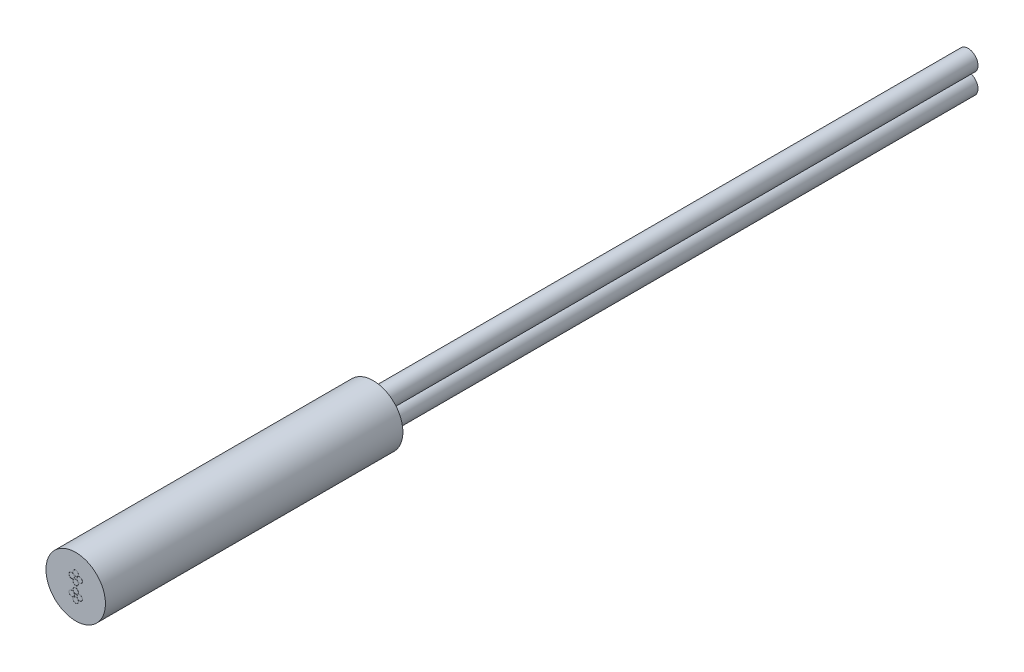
ISO-10303-21;
HEADER;
FILE_DESCRIPTION(('STEP AP214'),'2;1');
FILE_NAME('part.step','',(''),(''),'','','');
FILE_SCHEMA(('AUTOMOTIVE_DESIGN { 1 0 10303 214 1 1 1 1 }'));
ENDSEC;
DATA;
#1=APPLICATION_CONTEXT('core data for automotive mechanical design processes');
#2=APPLICATION_PROTOCOL_DEFINITION('international standard','automotive_design',2000,#1);
#3=PRODUCT_CONTEXT('',#1,'mechanical');
#4=PRODUCT('Part','Part','',(#3));
#5=PRODUCT_RELATED_PRODUCT_CATEGORY('part','',(#4));
#6=PRODUCT_DEFINITION_FORMATION('','',#4);
#7=PRODUCT_DEFINITION_CONTEXT('part definition',#1,'design');
#8=PRODUCT_DEFINITION('design','',#6,#7);
#9=PRODUCT_DEFINITION_SHAPE('','',#8);
#10=(LENGTH_UNIT() NAMED_UNIT(*) SI_UNIT(.MILLI.,.METRE.));
#11=(NAMED_UNIT(*) PLANE_ANGLE_UNIT() SI_UNIT($,.RADIAN.));
#12=(NAMED_UNIT(*) SI_UNIT($,.STERADIAN.) SOLID_ANGLE_UNIT());
#13=UNCERTAINTY_MEASURE_WITH_UNIT(LENGTH_MEASURE(1.E-05),#10,'distance_accuracy_value','');
#14=(GEOMETRIC_REPRESENTATION_CONTEXT(3) GLOBAL_UNCERTAINTY_ASSIGNED_CONTEXT((#13)) GLOBAL_UNIT_ASSIGNED_CONTEXT((#10,
#11,#12)) REPRESENTATION_CONTEXT('',''));
#15=CARTESIAN_POINT('',(0.,0.,0.));
#16=DIRECTION('',(0.,0.,1.));
#17=DIRECTION('',(1.,0.,0.));
#18=AXIS2_PLACEMENT_3D('',#15,#16,#17);
#19=CARTESIAN_POINT('',(0.,0.,-15.));
#20=DIRECTION('',(0.,0.,1.));
#21=DIRECTION('',(1.,0.,0.));
#22=AXIS2_PLACEMENT_3D('',#19,#20,#21);
#23=CYLINDRICAL_SURFACE('',#22,1.5);
#24=CARTESIAN_POINT('',(0.,0.,-15.));
#25=DIRECTION('',(0.,0.,1.));
#26=DIRECTION('',(1.,0.,0.));
#27=AXIS2_PLACEMENT_3D('',#24,#25,#26);
#28=CIRCLE('',#27,1.5);
#29=CARTESIAN_POINT('',(1.5,0.,-15.));
#30=VERTEX_POINT('',#29);
#31=EDGE_CURVE('E43',#30,#30,#28,.T.);
#32=ORIENTED_EDGE('',*,*,#31,.T.);
#33=EDGE_LOOP('',(#32));
#34=FACE_BOUND('',#33,.T.);
#35=CARTESIAN_POINT('',(0.,0.,0.));
#36=DIRECTION('',(0.,0.,1.));
#37=DIRECTION('',(1.,0.,0.));
#38=AXIS2_PLACEMENT_3D('',#35,#36,#37);
#39=CIRCLE('',#38,1.5);
#40=CARTESIAN_POINT('',(1.5,0.,0.));
#41=VERTEX_POINT('',#40);
#42=EDGE_CURVE('E47',#41,#41,#39,.T.);
#43=ORIENTED_EDGE('',*,*,#42,.F.);
#44=EDGE_LOOP('',(#43));
#45=FACE_BOUND('',#44,.T.);
#46=ADVANCED_FACE('F33',(#34,#45),#23,.T.);
#47=CARTESIAN_POINT('',(0.,0.,-15.));
#48=DIRECTION('',(0.,0.,1.));
#49=DIRECTION('',(1.,0.,0.));
#50=AXIS2_PLACEMENT_3D('',#47,#48,#49);
#51=PLANE('',#50);
#52=CARTESIAN_POINT('',(0.,-0.51,-15.));
#53=DIRECTION('',(0.,0.,1.));
#54=DIRECTION('',(1.,0.,0.));
#55=AXIS2_PLACEMENT_3D('',#52,#53,#54);
#56=CIRCLE('',#55,0.5);
#57=CARTESIAN_POINT('',(0.5,-0.51,-15.));
#58=VERTEX_POINT('',#57);
#59=EDGE_CURVE('E10',#58,#58,#56,.F.);
#60=ORIENTED_EDGE('',*,*,#59,.F.);
#61=EDGE_LOOP('',(#60));
#62=FACE_BOUND('',#61,.T.);
#63=CARTESIAN_POINT('',(0.,0.51,-15.));
#64=DIRECTION('',(0.,0.,1.));
#65=DIRECTION('',(1.,0.,0.));
#66=AXIS2_PLACEMENT_3D('',#63,#64,#65);
#67=CIRCLE('',#66,0.5);
#68=CARTESIAN_POINT('',(0.5,0.51,-15.));
#69=VERTEX_POINT('',#68);
#70=EDGE_CURVE('E39',#69,#69,#67,.F.);
#71=ORIENTED_EDGE('',*,*,#70,.F.);
#72=EDGE_LOOP('',(#71));
#73=FACE_BOUND('',#72,.T.);
#74=ORIENTED_EDGE('',*,*,#31,.F.);
#75=EDGE_LOOP('',(#74));
#76=FACE_BOUND('',#75,.T.);
#77=ADVANCED_FACE('F175',(#62,#73,#76),#51,.F.);
#78=CARTESIAN_POINT('',(0.,0.,0.));
#79=DIRECTION('',(0.,0.,1.));
#80=DIRECTION('',(1.,0.,0.));
#81=AXIS2_PLACEMENT_3D('',#78,#79,#80);
#82=PLANE('',#81);
#83=CARTESIAN_POINT('',(-0.201525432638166,-0.389025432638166,0.));
#84=DIRECTION('',(0.,0.,1.));
#85=DIRECTION('',(-1.,0.,0.));
#86=AXIS2_PLACEMENT_3D('',#83,#84,#85);
#87=CIRCLE('',#86,0.1375);
#88=CARTESIAN_POINT('',(-0.339025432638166,-0.389025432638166,0.));
#89=VERTEX_POINT('',#88);
#90=EDGE_CURVE('E95',#89,#89,#87,.T.);
#91=ORIENTED_EDGE('',*,*,#90,.F.);
#92=EDGE_LOOP('',(#91));
#93=FACE_BOUND('',#92,.T.);
#94=CARTESIAN_POINT('',(0.,0.1875,0.));
#95=DIRECTION('',(0.,0.,1.));
#96=DIRECTION('',(1.,0.,0.));
#97=AXIS2_PLACEMENT_3D('',#94,#95,#96);
#98=CIRCLE('',#97,0.1375);
#99=CARTESIAN_POINT('',(0.1375,0.1875,0.));
#100=VERTEX_POINT('',#99);
#101=EDGE_CURVE('E109',#100,#100,#98,.T.);
#102=ORIENTED_EDGE('',*,*,#101,.F.);
#103=EDGE_LOOP('',(#102));
#104=FACE_BOUND('',#103,.T.);
#105=CARTESIAN_POINT('',(0.201525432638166,0.389025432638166,0.));
#106=DIRECTION('',(0.,0.,1.));
#107=DIRECTION('',(1.,0.,0.));
#108=AXIS2_PLACEMENT_3D('',#105,#106,#107);
#109=CIRCLE('',#108,0.1375);
#110=CARTESIAN_POINT('',(0.339025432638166,0.389025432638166,0.));
#111=VERTEX_POINT('',#110);
#112=EDGE_CURVE('E71',#111,#111,#109,.T.);
#113=ORIENTED_EDGE('',*,*,#112,.F.);
#114=EDGE_LOOP('',(#113));
#115=FACE_BOUND('',#114,.T.);
#116=CARTESIAN_POINT('',(-0.201525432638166,0.389025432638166,0.));
#117=DIRECTION('',(0.,0.,1.));
#118=DIRECTION('',(1.,0.,0.));
#119=AXIS2_PLACEMENT_3D('',#116,#117,#118);
#120=CIRCLE('',#119,0.1375);
#121=CARTESIAN_POINT('',(-0.0640254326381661,0.389025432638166,0.));
#122=VERTEX_POINT('',#121);
#123=EDGE_CURVE('E85',#122,#122,#120,.T.);
#124=ORIENTED_EDGE('',*,*,#123,.F.);
#125=EDGE_LOOP('',(#124));
#126=FACE_BOUND('',#125,.T.);
#127=CARTESIAN_POINT('',(0.,-0.590550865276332,0.));
#128=DIRECTION('',(0.,0.,1.));
#129=DIRECTION('',(-1.,0.,0.));
#130=AXIS2_PLACEMENT_3D('',#127,#128,#129);
#131=CIRCLE('',#130,0.1375);
#132=CARTESIAN_POINT('',(-0.1375,-0.590550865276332,0.));
#133=VERTEX_POINT('',#132);
#134=EDGE_CURVE('E143',#133,#133,#131,.T.);
#135=ORIENTED_EDGE('',*,*,#134,.F.);
#136=EDGE_LOOP('',(#135));
#137=FACE_BOUND('',#136,.T.);
#138=CARTESIAN_POINT('',(0.,-0.1875,0.));
#139=DIRECTION('',(0.,0.,1.));
#140=DIRECTION('',(-1.,0.,0.));
#141=AXIS2_PLACEMENT_3D('',#138,#139,#140);
#142=CIRCLE('',#141,0.1375);
#143=CARTESIAN_POINT('',(-0.1375,-0.1875,0.));
#144=VERTEX_POINT('',#143);
#145=EDGE_CURVE('E119',#144,#144,#142,.T.);
#146=ORIENTED_EDGE('',*,*,#145,.F.);
#147=EDGE_LOOP('',(#146));
#148=FACE_BOUND('',#147,.T.);
#149=CARTESIAN_POINT('',(0.201525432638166,-0.389025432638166,0.));
#150=DIRECTION('',(0.,0.,1.));
#151=DIRECTION('',(-1.,0.,0.));
#152=AXIS2_PLACEMENT_3D('',#149,#150,#151);
#153=CIRCLE('',#152,0.1375);
#154=CARTESIAN_POINT('',(0.064025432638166,-0.389025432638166,0.));
#155=VERTEX_POINT('',#154);
#156=EDGE_CURVE('E131',#155,#155,#153,.T.);
#157=ORIENTED_EDGE('',*,*,#156,.F.);
#158=EDGE_LOOP('',(#157));
#159=FACE_BOUND('',#158,.T.);
#160=CARTESIAN_POINT('',(0.,0.590550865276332,0.));
#161=DIRECTION('',(0.,0.,1.));
#162=DIRECTION('',(1.,0.,0.));
#163=AXIS2_PLACEMENT_3D('',#160,#161,#162);
#164=CIRCLE('',#163,0.1375);
#165=CARTESIAN_POINT('',(0.1375,0.590550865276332,0.));
#166=VERTEX_POINT('',#165);
#167=EDGE_CURVE('E59',#166,#166,#164,.T.);
#168=ORIENTED_EDGE('',*,*,#167,.F.);
#169=EDGE_LOOP('',(#168));
#170=FACE_BOUND('',#169,.T.);
#171=ORIENTED_EDGE('',*,*,#42,.T.);
#172=EDGE_LOOP('',(#171));
#173=FACE_BOUND('',#172,.T.);
#174=ADVANCED_FACE('F171',(#93,#104,#115,#126,#137,#148,#159,#170,#173),#82,.T.);
#175=CARTESIAN_POINT('',(0.,0.51,-45.));
#176=DIRECTION('',(0.,0.,1.));
#177=DIRECTION('',(1.,0.,0.));
#178=AXIS2_PLACEMENT_3D('',#175,#176,#177);
#179=CYLINDRICAL_SURFACE('',#178,0.5);
#180=CARTESIAN_POINT('',(0.,0.51,-45.));
#181=DIRECTION('',(0.,0.,-1.));
#182=DIRECTION('',(-1.,0.,0.));
#183=AXIS2_PLACEMENT_3D('',#180,#181,#182);
#184=CIRCLE('',#183,0.5);
#185=CARTESIAN_POINT('',(-0.5,0.51,-45.));
#186=VERTEX_POINT('',#185);
#187=EDGE_CURVE('E51',#186,#186,#184,.T.);
#188=ORIENTED_EDGE('',*,*,#187,.F.);
#189=EDGE_LOOP('',(#188));
#190=FACE_BOUND('',#189,.T.);
#191=ORIENTED_EDGE('',*,*,#70,.T.);
#192=EDGE_LOOP('',(#191));
#193=FACE_BOUND('',#192,.T.);
#194=ADVANCED_FACE('F174',(#190,#193),#179,.T.);
#195=CARTESIAN_POINT('',(0.,0.51,-45.));
#196=DIRECTION('',(0.,0.,-1.));
#197=DIRECTION('',(-1.,0.,0.));
#198=AXIS2_PLACEMENT_3D('',#195,#196,#197);
#199=PLANE('',#198);
#200=ORIENTED_EDGE('',*,*,#187,.T.);
#201=EDGE_LOOP('',(#200));
#202=FACE_BOUND('',#201,.T.);
#203=ADVANCED_FACE('F202',(#202),#199,.T.);
#204=CARTESIAN_POINT('',(0.,-0.51,-45.));
#205=DIRECTION('',(0.,0.,1.));
#206=DIRECTION('',(1.,0.,0.));
#207=AXIS2_PLACEMENT_3D('',#204,#205,#206);
#208=CYLINDRICAL_SURFACE('',#207,0.5);
#209=CARTESIAN_POINT('',(0.,-0.51,-45.));
#210=DIRECTION('',(0.,0.,-1.));
#211=DIRECTION('',(-1.,0.,0.));
#212=AXIS2_PLACEMENT_3D('',#209,#210,#211);
#213=CIRCLE('',#212,0.5);
#214=CARTESIAN_POINT('',(-0.5,-0.51,-45.));
#215=VERTEX_POINT('',#214);
#216=EDGE_CURVE('E55',#215,#215,#213,.T.);
#217=ORIENTED_EDGE('',*,*,#216,.F.);
#218=EDGE_LOOP('',(#217));
#219=FACE_BOUND('',#218,.T.);
#220=ORIENTED_EDGE('',*,*,#59,.T.);
#221=EDGE_LOOP('',(#220));
#222=FACE_BOUND('',#221,.T.);
#223=ADVANCED_FACE('F206',(#219,#222),#208,.T.);
#224=CARTESIAN_POINT('',(0.,-0.51,-45.));
#225=DIRECTION('',(0.,0.,-1.));
#226=DIRECTION('',(-1.,0.,0.));
#227=AXIS2_PLACEMENT_3D('',#224,#225,#226);
#228=PLANE('',#227);
#229=ORIENTED_EDGE('',*,*,#216,.T.);
#230=EDGE_LOOP('',(#229));
#231=FACE_BOUND('',#230,.T.);
#232=ADVANCED_FACE('F210',(#231),#228,.T.);
#233=CARTESIAN_POINT('',(0.,0.590550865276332,-0.1));
#234=DIRECTION('',(0.,0.,1.));
#235=DIRECTION('',(1.,0.,0.));
#236=AXIS2_PLACEMENT_3D('',#233,#234,#235);
#237=CYLINDRICAL_SURFACE('',#236,0.1375);
#238=CARTESIAN_POINT('',(0.,0.590550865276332,-0.1));
#239=DIRECTION('',(0.,0.,1.));
#240=DIRECTION('',(1.,0.,0.));
#241=AXIS2_PLACEMENT_3D('',#238,#239,#240);
#242=CIRCLE('',#241,0.1375);
#243=CARTESIAN_POINT('',(0.1375,0.590550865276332,-0.1));
#244=VERTEX_POINT('',#243);
#245=EDGE_CURVE('E58',#244,#244,#242,.T.);
#246=ORIENTED_EDGE('',*,*,#245,.F.);
#247=EDGE_LOOP('',(#246));
#248=FACE_BOUND('',#247,.T.);
#249=ORIENTED_EDGE('',*,*,#167,.T.);
#250=EDGE_LOOP('',(#249));
#251=FACE_BOUND('',#250,.T.);
#252=ADVANCED_FACE('F214',(#248,#251),#237,.F.);
#253=CARTESIAN_POINT('',(0.,0.590550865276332,-0.1));
#254=DIRECTION('',(0.,0.,1.));
#255=DIRECTION('',(1.,0.,0.));
#256=AXIS2_PLACEMENT_3D('',#253,#254,#255);
#257=PLANE('',#256);
#258=CARTESIAN_POINT('',(0.,0.590550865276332,-0.1));
#259=DIRECTION('',(0.,0.,1.));
#260=DIRECTION('',(1.,0.,0.));
#261=AXIS2_PLACEMENT_3D('',#258,#259,#260);
#262=CIRCLE('',#261,0.1325);
#263=CARTESIAN_POINT('',(0.1325,0.590550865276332,-0.1));
#264=VERTEX_POINT('',#263);
#265=EDGE_CURVE('E62',#264,#264,#262,.T.);
#266=ORIENTED_EDGE('',*,*,#265,.F.);
#267=EDGE_LOOP('',(#266));
#268=FACE_BOUND('',#267,.T.);
#269=ORIENTED_EDGE('',*,*,#245,.T.);
#270=EDGE_LOOP('',(#269));
#271=FACE_BOUND('',#270,.T.);
#272=ADVANCED_FACE('F218',(#268,#271),#257,.T.);
#273=CARTESIAN_POINT('',(0.,0.590550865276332,-0.1));
#274=DIRECTION('',(0.,0.,1.));
#275=DIRECTION('',(1.,0.,0.));
#276=AXIS2_PLACEMENT_3D('',#273,#274,#275);
#277=CYLINDRICAL_SURFACE('',#276,0.1325);
#278=ORIENTED_EDGE('',*,*,#265,.T.);
#279=EDGE_LOOP('',(#278));
#280=FACE_BOUND('',#279,.T.);
#281=CARTESIAN_POINT('',(0.,0.590550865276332,0.));
#282=DIRECTION('',(0.,0.,1.));
#283=DIRECTION('',(1.,0.,0.));
#284=AXIS2_PLACEMENT_3D('',#281,#282,#283);
#285=CIRCLE('',#284,0.1325);
#286=CARTESIAN_POINT('',(0.1325,0.590550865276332,0.));
#287=VERTEX_POINT('',#286);
#288=EDGE_CURVE('E65',#287,#287,#285,.T.);
#289=ORIENTED_EDGE('',*,*,#288,.F.);
#290=EDGE_LOOP('',(#289));
#291=FACE_BOUND('',#290,.T.);
#292=ADVANCED_FACE('F222',(#280,#291),#277,.T.);
#293=CARTESIAN_POINT('',(0.201525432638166,-0.389025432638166,-0.1));
#294=DIRECTION('',(0.,0.,1.));
#295=DIRECTION('',(1.,0.,0.));
#296=AXIS2_PLACEMENT_3D('',#293,#294,#295);
#297=CYLINDRICAL_SURFACE('',#296,0.1375);
#298=CARTESIAN_POINT('',(0.201525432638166,-0.389025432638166,-0.1));
#299=DIRECTION('',(0.,0.,1.));
#300=DIRECTION('',(-1.,0.,0.));
#301=AXIS2_PLACEMENT_3D('',#298,#299,#300);
#302=CIRCLE('',#301,0.1375);
#303=CARTESIAN_POINT('',(0.064025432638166,-0.389025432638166,-0.1));
#304=VERTEX_POINT('',#303);
#305=EDGE_CURVE('E128',#304,#304,#302,.T.);
#306=ORIENTED_EDGE('',*,*,#305,.F.);
#307=EDGE_LOOP('',(#306));
#308=FACE_BOUND('',#307,.T.);
#309=ORIENTED_EDGE('',*,*,#156,.T.);
#310=EDGE_LOOP('',(#309));
#311=FACE_BOUND('',#310,.T.);
#312=ADVANCED_FACE('F226',(#308,#311),#297,.F.);
#313=CARTESIAN_POINT('',(0.201525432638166,-0.389025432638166,-0.1));
#314=DIRECTION('',(0.,0.,-1.));
#315=DIRECTION('',(-1.,0.,0.));
#316=AXIS2_PLACEMENT_3D('',#313,#314,#315);
#317=PLANE('',#316);
#318=CARTESIAN_POINT('',(0.201525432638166,-0.389025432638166,-0.1));
#319=DIRECTION('',(0.,0.,1.));
#320=DIRECTION('',(-1.,0.,0.));
#321=AXIS2_PLACEMENT_3D('',#318,#319,#320);
#322=CIRCLE('',#321,0.1325);
#323=CARTESIAN_POINT('',(0.0690254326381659,-0.389025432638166,-0.1));
#324=VERTEX_POINT('',#323);
#325=EDGE_CURVE('E134',#324,#324,#322,.T.);
#326=ORIENTED_EDGE('',*,*,#325,.F.);
#327=EDGE_LOOP('',(#326));
#328=FACE_BOUND('',#327,.T.);
#329=ORIENTED_EDGE('',*,*,#305,.T.);
#330=EDGE_LOOP('',(#329));
#331=FACE_BOUND('',#330,.T.);
#332=ADVANCED_FACE('F290',(#328,#331),#317,.F.);
#333=CARTESIAN_POINT('',(0.201525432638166,-0.389025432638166,-0.1));
#334=DIRECTION('',(0.,0.,1.));
#335=DIRECTION('',(1.,0.,0.));
#336=AXIS2_PLACEMENT_3D('',#333,#334,#335);
#337=CYLINDRICAL_SURFACE('',#336,0.1325);
#338=ORIENTED_EDGE('',*,*,#325,.T.);
#339=EDGE_LOOP('',(#338));
#340=FACE_BOUND('',#339,.T.);
#341=CARTESIAN_POINT('',(0.201525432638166,-0.389025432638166,0.));
#342=DIRECTION('',(0.,0.,1.));
#343=DIRECTION('',(-1.,0.,0.));
#344=AXIS2_PLACEMENT_3D('',#341,#342,#343);
#345=CIRCLE('',#344,0.1325);
#346=CARTESIAN_POINT('',(0.0690254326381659,-0.389025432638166,0.));
#347=VERTEX_POINT('',#346);
#348=EDGE_CURVE('E137',#347,#347,#345,.T.);
#349=ORIENTED_EDGE('',*,*,#348,.F.);
#350=EDGE_LOOP('',(#349));
#351=FACE_BOUND('',#350,.T.);
#352=ADVANCED_FACE('F280',(#340,#351),#337,.T.);
#353=CARTESIAN_POINT('',(0.,-0.1875,-0.1));
#354=DIRECTION('',(0.,0.,1.));
#355=DIRECTION('',(1.,0.,0.));
#356=AXIS2_PLACEMENT_3D('',#353,#354,#355);
#357=CYLINDRICAL_SURFACE('',#356,0.1375);
#358=CARTESIAN_POINT('',(0.,-0.1875,-0.1));
#359=DIRECTION('',(0.,0.,1.));
#360=DIRECTION('',(-1.,0.,0.));
#361=AXIS2_PLACEMENT_3D('',#358,#359,#360);
#362=CIRCLE('',#361,0.1375);
#363=CARTESIAN_POINT('',(-0.1375,-0.1875,-0.1));
#364=VERTEX_POINT('',#363);
#365=EDGE_CURVE('E106',#364,#364,#362,.T.);
#366=ORIENTED_EDGE('',*,*,#365,.F.);
#367=EDGE_LOOP('',(#366));
#368=FACE_BOUND('',#367,.T.);
#369=ORIENTED_EDGE('',*,*,#145,.T.);
#370=EDGE_LOOP('',(#369));
#371=FACE_BOUND('',#370,.T.);
#372=ADVANCED_FACE('F276',(#368,#371),#357,.F.);
#373=CARTESIAN_POINT('',(0.,-0.1875,-0.1));
#374=DIRECTION('',(0.,0.,-1.));
#375=DIRECTION('',(-1.,0.,0.));
#376=AXIS2_PLACEMENT_3D('',#373,#374,#375);
#377=PLANE('',#376);
#378=CARTESIAN_POINT('',(0.,-0.1875,-0.1));
#379=DIRECTION('',(0.,0.,1.));
#380=DIRECTION('',(-1.,0.,0.));
#381=AXIS2_PLACEMENT_3D('',#378,#379,#380);
#382=CIRCLE('',#381,0.1325);
#383=CARTESIAN_POINT('',(-0.1325,-0.1875,-0.1));
#384=VERTEX_POINT('',#383);
#385=EDGE_CURVE('E122',#384,#384,#382,.T.);
#386=ORIENTED_EDGE('',*,*,#385,.F.);
#387=EDGE_LOOP('',(#386));
#388=FACE_BOUND('',#387,.T.);
#389=ORIENTED_EDGE('',*,*,#365,.T.);
#390=EDGE_LOOP('',(#389));
#391=FACE_BOUND('',#390,.T.);
#392=ADVANCED_FACE('F279',(#388,#391),#377,.F.);
#393=CARTESIAN_POINT('',(0.,-0.1875,-0.1));
#394=DIRECTION('',(0.,0.,1.));
#395=DIRECTION('',(1.,0.,0.));
#396=AXIS2_PLACEMENT_3D('',#393,#394,#395);
#397=CYLINDRICAL_SURFACE('',#396,0.1325);
#398=ORIENTED_EDGE('',*,*,#385,.T.);
#399=EDGE_LOOP('',(#398));
#400=FACE_BOUND('',#399,.T.);
#401=CARTESIAN_POINT('',(0.,-0.1875,0.));
#402=DIRECTION('',(0.,0.,1.));
#403=DIRECTION('',(-1.,0.,0.));
#404=AXIS2_PLACEMENT_3D('',#401,#402,#403);
#405=CIRCLE('',#404,0.1325);
#406=CARTESIAN_POINT('',(-0.1325,-0.1875,0.));
#407=VERTEX_POINT('',#406);
#408=EDGE_CURVE('E125',#407,#407,#405,.T.);
#409=ORIENTED_EDGE('',*,*,#408,.F.);
#410=EDGE_LOOP('',(#409));
#411=FACE_BOUND('',#410,.T.);
#412=ADVANCED_FACE('F167',(#400,#411),#397,.T.);
#413=CARTESIAN_POINT('',(0.,-0.590550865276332,-0.1));
#414=DIRECTION('',(0.,0.,1.));
#415=DIRECTION('',(1.,0.,0.));
#416=AXIS2_PLACEMENT_3D('',#413,#414,#415);
#417=CYLINDRICAL_SURFACE('',#416,0.1375);
#418=CARTESIAN_POINT('',(0.,-0.590550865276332,-0.1));
#419=DIRECTION('',(0.,0.,1.));
#420=DIRECTION('',(-1.,0.,0.));
#421=AXIS2_PLACEMENT_3D('',#418,#419,#420);
#422=CIRCLE('',#421,0.1375);
#423=CARTESIAN_POINT('',(-0.1375,-0.590550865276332,-0.1));
#424=VERTEX_POINT('',#423);
#425=EDGE_CURVE('E140',#424,#424,#422,.T.);
#426=ORIENTED_EDGE('',*,*,#425,.F.);
#427=EDGE_LOOP('',(#426));
#428=FACE_BOUND('',#427,.T.);
#429=ORIENTED_EDGE('',*,*,#134,.T.);
#430=EDGE_LOOP('',(#429));
#431=FACE_BOUND('',#430,.T.);
#432=ADVANCED_FACE('F161',(#428,#431),#417,.F.);
#433=CARTESIAN_POINT('',(0.,-0.590550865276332,-0.1));
#434=DIRECTION('',(0.,0.,-1.));
#435=DIRECTION('',(-1.,0.,0.));
#436=AXIS2_PLACEMENT_3D('',#433,#434,#435);
#437=PLANE('',#436);
#438=CARTESIAN_POINT('',(0.,-0.590550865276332,-0.1));
#439=DIRECTION('',(0.,0.,1.));
#440=DIRECTION('',(-1.,0.,0.));
#441=AXIS2_PLACEMENT_3D('',#438,#439,#440);
#442=CIRCLE('',#441,0.1325);
#443=CARTESIAN_POINT('',(-0.1325,-0.590550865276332,-0.1));
#444=VERTEX_POINT('',#443);
#445=EDGE_CURVE('E146',#444,#444,#442,.T.);
#446=ORIENTED_EDGE('',*,*,#445,.F.);
#447=EDGE_LOOP('',(#446));
#448=FACE_BOUND('',#447,.T.);
#449=ORIENTED_EDGE('',*,*,#425,.T.);
#450=EDGE_LOOP('',(#449));
#451=FACE_BOUND('',#450,.T.);
#452=ADVANCED_FACE('F158',(#448,#451),#437,.F.);
#453=CARTESIAN_POINT('',(0.,-0.590550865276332,-0.1));
#454=DIRECTION('',(0.,0.,1.));
#455=DIRECTION('',(1.,0.,0.));
#456=AXIS2_PLACEMENT_3D('',#453,#454,#455);
#457=CYLINDRICAL_SURFACE('',#456,0.1325);
#458=ORIENTED_EDGE('',*,*,#445,.T.);
#459=EDGE_LOOP('',(#458));
#460=FACE_BOUND('',#459,.T.);
#461=CARTESIAN_POINT('',(0.,-0.590550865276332,0.));
#462=DIRECTION('',(0.,0.,1.));
#463=DIRECTION('',(-1.,0.,0.));
#464=AXIS2_PLACEMENT_3D('',#461,#462,#463);
#465=CIRCLE('',#464,0.1325);
#466=CARTESIAN_POINT('',(-0.1325,-0.590550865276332,0.));
#467=VERTEX_POINT('',#466);
#468=EDGE_CURVE('E149',#467,#467,#465,.T.);
#469=ORIENTED_EDGE('',*,*,#468,.F.);
#470=EDGE_LOOP('',(#469));
#471=FACE_BOUND('',#470,.T.);
#472=ADVANCED_FACE('F155',(#460,#471),#457,.T.);
#473=CARTESIAN_POINT('',(-0.201525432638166,0.389025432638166,-0.1));
#474=DIRECTION('',(0.,0.,1.));
#475=DIRECTION('',(1.,0.,0.));
#476=AXIS2_PLACEMENT_3D('',#473,#474,#475);
#477=CYLINDRICAL_SURFACE('',#476,0.1375);
#478=CARTESIAN_POINT('',(-0.201525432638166,0.389025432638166,-0.1));
#479=DIRECTION('',(0.,0.,1.));
#480=DIRECTION('',(1.,0.,0.));
#481=AXIS2_PLACEMENT_3D('',#478,#479,#480);
#482=CIRCLE('',#481,0.1375);
#483=CARTESIAN_POINT('',(-0.0640254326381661,0.389025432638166,-0.1));
#484=VERTEX_POINT('',#483);
#485=EDGE_CURVE('E68',#484,#484,#482,.T.);
#486=ORIENTED_EDGE('',*,*,#485,.F.);
#487=EDGE_LOOP('',(#486));
#488=FACE_BOUND('',#487,.T.);
#489=ORIENTED_EDGE('',*,*,#123,.T.);
#490=EDGE_LOOP('',(#489));
#491=FACE_BOUND('',#490,.T.);
#492=ADVANCED_FACE('F242',(#488,#491),#477,.F.);
#493=CARTESIAN_POINT('',(-0.201525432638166,0.389025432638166,-0.1));
#494=DIRECTION('',(0.,0.,1.));
#495=DIRECTION('',(1.,0.,0.));
#496=AXIS2_PLACEMENT_3D('',#493,#494,#495);
#497=PLANE('',#496);
#498=CARTESIAN_POINT('',(-0.201525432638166,0.389025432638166,-0.1));
#499=DIRECTION('',(0.,0.,1.));
#500=DIRECTION('',(1.,0.,0.));
#501=AXIS2_PLACEMENT_3D('',#498,#499,#500);
#502=CIRCLE('',#501,0.1325);
#503=CARTESIAN_POINT('',(-0.0690254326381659,0.389025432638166,-0.1));
#504=VERTEX_POINT('',#503);
#505=EDGE_CURVE('E88',#504,#504,#502,.T.);
#506=ORIENTED_EDGE('',*,*,#505,.F.);
#507=EDGE_LOOP('',(#506));
#508=FACE_BOUND('',#507,.T.);
#509=ORIENTED_EDGE('',*,*,#485,.T.);
#510=EDGE_LOOP('',(#509));
#511=FACE_BOUND('',#510,.T.);
#512=ADVANCED_FACE('F245',(#508,#511),#497,.T.);
#513=CARTESIAN_POINT('',(-0.201525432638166,0.389025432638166,-0.1));
#514=DIRECTION('',(0.,0.,1.));
#515=DIRECTION('',(1.,0.,0.));
#516=AXIS2_PLACEMENT_3D('',#513,#514,#515);
#517=CYLINDRICAL_SURFACE('',#516,0.1325);
#518=ORIENTED_EDGE('',*,*,#505,.T.);
#519=EDGE_LOOP('',(#518));
#520=FACE_BOUND('',#519,.T.);
#521=CARTESIAN_POINT('',(-0.201525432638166,0.389025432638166,0.));
#522=DIRECTION('',(0.,0.,1.));
#523=DIRECTION('',(1.,0.,0.));
#524=AXIS2_PLACEMENT_3D('',#521,#522,#523);
#525=CIRCLE('',#524,0.1325);
#526=CARTESIAN_POINT('',(-0.0690254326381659,0.389025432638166,0.));
#527=VERTEX_POINT('',#526);
#528=EDGE_CURVE('E78',#527,#527,#525,.T.);
#529=ORIENTED_EDGE('',*,*,#528,.F.);
#530=EDGE_LOOP('',(#529));
#531=FACE_BOUND('',#530,.T.);
#532=ADVANCED_FACE('F232',(#520,#531),#517,.T.);
#533=CARTESIAN_POINT('',(0.201525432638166,0.389025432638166,-0.1));
#534=DIRECTION('',(0.,0.,1.));
#535=DIRECTION('',(1.,0.,0.));
#536=AXIS2_PLACEMENT_3D('',#533,#534,#535);
#537=CYLINDRICAL_SURFACE('',#536,0.1375);
#538=CARTESIAN_POINT('',(0.201525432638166,0.389025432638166,-0.1));
#539=DIRECTION('',(0.,0.,1.));
#540=DIRECTION('',(1.,0.,0.));
#541=AXIS2_PLACEMENT_3D('',#538,#539,#540);
#542=CIRCLE('',#541,0.1375);
#543=CARTESIAN_POINT('',(0.339025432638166,0.389025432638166,-0.1));
#544=VERTEX_POINT('',#543);
#545=EDGE_CURVE('E74',#544,#544,#542,.T.);
#546=ORIENTED_EDGE('',*,*,#545,.F.);
#547=EDGE_LOOP('',(#546));
#548=FACE_BOUND('',#547,.T.);
#549=ORIENTED_EDGE('',*,*,#112,.T.);
#550=EDGE_LOOP('',(#549));
#551=FACE_BOUND('',#550,.T.);
#552=ADVANCED_FACE('F228',(#548,#551),#537,.F.);
#553=CARTESIAN_POINT('',(0.201525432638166,0.389025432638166,-0.1));
#554=DIRECTION('',(0.,0.,1.));
#555=DIRECTION('',(1.,0.,0.));
#556=AXIS2_PLACEMENT_3D('',#553,#554,#555);
#557=PLANE('',#556);
#558=CARTESIAN_POINT('',(0.201525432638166,0.389025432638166,-0.1));
#559=DIRECTION('',(0.,0.,1.));
#560=DIRECTION('',(1.,0.,0.));
#561=AXIS2_PLACEMENT_3D('',#558,#559,#560);
#562=CIRCLE('',#561,0.1325);
#563=CARTESIAN_POINT('',(0.334025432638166,0.389025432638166,-0.1));
#564=VERTEX_POINT('',#563);
#565=EDGE_CURVE('E75',#564,#564,#562,.T.);
#566=ORIENTED_EDGE('',*,*,#565,.F.);
#567=EDGE_LOOP('',(#566));
#568=FACE_BOUND('',#567,.T.);
#569=ORIENTED_EDGE('',*,*,#545,.T.);
#570=EDGE_LOOP('',(#569));
#571=FACE_BOUND('',#570,.T.);
#572=ADVANCED_FACE('F231',(#568,#571),#557,.T.);
#573=CARTESIAN_POINT('',(0.201525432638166,0.389025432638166,-0.1));
#574=DIRECTION('',(0.,0.,1.));
#575=DIRECTION('',(1.,0.,0.));
#576=AXIS2_PLACEMENT_3D('',#573,#574,#575);
#577=CYLINDRICAL_SURFACE('',#576,0.1325);
#578=ORIENTED_EDGE('',*,*,#565,.T.);
#579=EDGE_LOOP('',(#578));
#580=FACE_BOUND('',#579,.T.);
#581=CARTESIAN_POINT('',(0.201525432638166,0.389025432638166,0.));
#582=DIRECTION('',(0.,0.,1.));
#583=DIRECTION('',(1.,0.,0.));
#584=AXIS2_PLACEMENT_3D('',#581,#582,#583);
#585=CIRCLE('',#584,0.1325);
#586=CARTESIAN_POINT('',(0.334025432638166,0.389025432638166,0.));
#587=VERTEX_POINT('',#586);
#588=EDGE_CURVE('E79',#587,#587,#585,.T.);
#589=ORIENTED_EDGE('',*,*,#588,.F.);
#590=EDGE_LOOP('',(#589));
#591=FACE_BOUND('',#590,.T.);
#592=ADVANCED_FACE('F236',(#580,#591),#577,.T.);
#593=CARTESIAN_POINT('',(0.,0.1875,-0.1));
#594=DIRECTION('',(0.,0.,1.));
#595=DIRECTION('',(1.,0.,0.));
#596=AXIS2_PLACEMENT_3D('',#593,#594,#595);
#597=CYLINDRICAL_SURFACE('',#596,0.1375);
#598=CARTESIAN_POINT('',(0.,0.1875,-0.1));
#599=DIRECTION('',(0.,0.,1.));
#600=DIRECTION('',(1.,0.,0.));
#601=AXIS2_PLACEMENT_3D('',#598,#599,#600);
#602=CIRCLE('',#601,0.1375);
#603=CARTESIAN_POINT('',(0.1375,0.1875,-0.1));
#604=VERTEX_POINT('',#603);
#605=EDGE_CURVE('E82',#604,#604,#602,.T.);
#606=ORIENTED_EDGE('',*,*,#605,.F.);
#607=EDGE_LOOP('',(#606));
#608=FACE_BOUND('',#607,.T.);
#609=ORIENTED_EDGE('',*,*,#101,.T.);
#610=EDGE_LOOP('',(#609));
#611=FACE_BOUND('',#610,.T.);
#612=ADVANCED_FACE('F240',(#608,#611),#597,.F.);
#613=CARTESIAN_POINT('',(0.,0.1875,-0.1));
#614=DIRECTION('',(0.,0.,1.));
#615=DIRECTION('',(1.,0.,0.));
#616=AXIS2_PLACEMENT_3D('',#613,#614,#615);
#617=PLANE('',#616);
#618=CARTESIAN_POINT('',(0.,0.1875,-0.1));
#619=DIRECTION('',(0.,0.,1.));
#620=DIRECTION('',(1.,0.,0.));
#621=AXIS2_PLACEMENT_3D('',#618,#619,#620);
#622=CIRCLE('',#621,0.1325);
#623=CARTESIAN_POINT('',(0.1325,0.1875,-0.1));
#624=VERTEX_POINT('',#623);
#625=EDGE_CURVE('E112',#624,#624,#622,.T.);
#626=ORIENTED_EDGE('',*,*,#625,.F.);
#627=EDGE_LOOP('',(#626));
#628=FACE_BOUND('',#627,.T.);
#629=ORIENTED_EDGE('',*,*,#605,.T.);
#630=EDGE_LOOP('',(#629));
#631=FACE_BOUND('',#630,.T.);
#632=ADVANCED_FACE('F268',(#628,#631),#617,.T.);
#633=CARTESIAN_POINT('',(0.,0.1875,-0.1));
#634=DIRECTION('',(0.,0.,1.));
#635=DIRECTION('',(1.,0.,0.));
#636=AXIS2_PLACEMENT_3D('',#633,#634,#635);
#637=CYLINDRICAL_SURFACE('',#636,0.1325);
#638=ORIENTED_EDGE('',*,*,#625,.T.);
#639=EDGE_LOOP('',(#638));
#640=FACE_BOUND('',#639,.T.);
#641=CARTESIAN_POINT('',(0.,0.1875,0.));
#642=DIRECTION('',(0.,0.,1.));
#643=DIRECTION('',(1.,0.,0.));
#644=AXIS2_PLACEMENT_3D('',#641,#642,#643);
#645=CIRCLE('',#644,0.1325);
#646=CARTESIAN_POINT('',(0.1325,0.1875,0.));
#647=VERTEX_POINT('',#646);
#648=EDGE_CURVE('E102',#647,#647,#645,.T.);
#649=ORIENTED_EDGE('',*,*,#648,.F.);
#650=EDGE_LOOP('',(#649));
#651=FACE_BOUND('',#650,.T.);
#652=ADVANCED_FACE('F257',(#640,#651),#637,.T.);
#653=CARTESIAN_POINT('',(-0.201525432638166,-0.389025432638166,-0.1));
#654=DIRECTION('',(0.,0.,1.));
#655=DIRECTION('',(1.,0.,0.));
#656=AXIS2_PLACEMENT_3D('',#653,#654,#655);
#657=CYLINDRICAL_SURFACE('',#656,0.1375);
#658=CARTESIAN_POINT('',(-0.201525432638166,-0.389025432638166,-0.1));
#659=DIRECTION('',(0.,0.,1.));
#660=DIRECTION('',(-1.,0.,0.));
#661=AXIS2_PLACEMENT_3D('',#658,#659,#660);
#662=CIRCLE('',#661,0.1375);
#663=CARTESIAN_POINT('',(-0.339025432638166,-0.389025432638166,-0.1));
#664=VERTEX_POINT('',#663);
#665=EDGE_CURVE('E98',#664,#664,#662,.T.);
#666=ORIENTED_EDGE('',*,*,#665,.F.);
#667=EDGE_LOOP('',(#666));
#668=FACE_BOUND('',#667,.T.);
#669=ORIENTED_EDGE('',*,*,#90,.T.);
#670=EDGE_LOOP('',(#669));
#671=FACE_BOUND('',#670,.T.);
#672=ADVANCED_FACE('F253',(#668,#671),#657,.F.);
#673=CARTESIAN_POINT('',(-0.201525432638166,-0.389025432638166,-0.1));
#674=DIRECTION('',(0.,0.,-1.));
#675=DIRECTION('',(-1.,0.,0.));
#676=AXIS2_PLACEMENT_3D('',#673,#674,#675);
#677=PLANE('',#676);
#678=CARTESIAN_POINT('',(-0.201525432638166,-0.389025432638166,-0.1));
#679=DIRECTION('',(0.,0.,1.));
#680=DIRECTION('',(-1.,0.,0.));
#681=AXIS2_PLACEMENT_3D('',#678,#679,#680);
#682=CIRCLE('',#681,0.1325);
#683=CARTESIAN_POINT('',(-0.334025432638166,-0.389025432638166,-0.1));
#684=VERTEX_POINT('',#683);
#685=EDGE_CURVE('E99',#684,#684,#682,.T.);
#686=ORIENTED_EDGE('',*,*,#685,.F.);
#687=EDGE_LOOP('',(#686));
#688=FACE_BOUND('',#687,.T.);
#689=ORIENTED_EDGE('',*,*,#665,.T.);
#690=EDGE_LOOP('',(#689));
#691=FACE_BOUND('',#690,.T.);
#692=ADVANCED_FACE('F256',(#688,#691),#677,.F.);
#693=CARTESIAN_POINT('',(-0.201525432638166,-0.389025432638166,-0.1));
#694=DIRECTION('',(0.,0.,1.));
#695=DIRECTION('',(1.,0.,0.));
#696=AXIS2_PLACEMENT_3D('',#693,#694,#695);
#697=CYLINDRICAL_SURFACE('',#696,0.1325);
#698=ORIENTED_EDGE('',*,*,#685,.T.);
#699=EDGE_LOOP('',(#698));
#700=FACE_BOUND('',#699,.T.);
#701=CARTESIAN_POINT('',(-0.201525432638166,-0.389025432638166,0.));
#702=DIRECTION('',(0.,0.,1.));
#703=DIRECTION('',(-1.,0.,0.));
#704=AXIS2_PLACEMENT_3D('',#701,#702,#703);
#705=CIRCLE('',#704,0.1325);
#706=CARTESIAN_POINT('',(-0.334025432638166,-0.389025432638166,0.));
#707=VERTEX_POINT('',#706);
#708=EDGE_CURVE('E103',#707,#707,#705,.T.);
#709=ORIENTED_EDGE('',*,*,#708,.F.);
#710=EDGE_LOOP('',(#709));
#711=FACE_BOUND('',#710,.T.);
#712=ADVANCED_FACE('F261',(#700,#711),#697,.T.);
#713=ORIENTED_EDGE('',*,*,#288,.T.);
#714=EDGE_LOOP('',(#713));
#715=FACE_BOUND('',#714,.T.);
#716=ADVANCED_FACE('F178',(#715),#82,.T.);
#717=ORIENTED_EDGE('',*,*,#348,.T.);
#718=EDGE_LOOP('',(#717));
#719=FACE_BOUND('',#718,.T.);
#720=ADVANCED_FACE('F357',(#719),#82,.T.);
#721=ORIENTED_EDGE('',*,*,#408,.T.);
#722=EDGE_LOOP('',(#721));
#723=FACE_BOUND('',#722,.T.);
#724=ADVANCED_FACE('F364',(#723),#82,.T.);
#725=ORIENTED_EDGE('',*,*,#468,.T.);
#726=EDGE_LOOP('',(#725));
#727=FACE_BOUND('',#726,.T.);
#728=ADVANCED_FACE('F371',(#727),#82,.T.);
#729=ORIENTED_EDGE('',*,*,#528,.T.);
#730=EDGE_LOOP('',(#729));
#731=FACE_BOUND('',#730,.T.);
#732=ADVANCED_FACE('F378',(#731),#82,.T.);
#733=ORIENTED_EDGE('',*,*,#588,.T.);
#734=EDGE_LOOP('',(#733));
#735=FACE_BOUND('',#734,.T.);
#736=ADVANCED_FACE('F385',(#735),#82,.T.);
#737=ORIENTED_EDGE('',*,*,#648,.T.);
#738=EDGE_LOOP('',(#737));
#739=FACE_BOUND('',#738,.T.);
#740=ADVANCED_FACE('F392',(#739),#82,.T.);
#741=ORIENTED_EDGE('',*,*,#708,.T.);
#742=EDGE_LOOP('',(#741));
#743=FACE_BOUND('',#742,.T.);
#744=ADVANCED_FACE('F177',(#743),#82,.T.);
#745=CLOSED_SHELL('',(#46,#77,#174,#194,#203,#223,#232,#252,#272,#292,#312,#332,#352,#372,#392,
#412,#432,#452,#472,#492,#512,#532,#552,#572,#592,#612,#632,#652,#672,#692,#712,#716,#720,#724,
#728,#732,#736,#740,#744));
#746=MANIFOLD_SOLID_BREP('B2',#745);
#747=ADVANCED_BREP_SHAPE_REPRESENTATION('',(#18,#746),#14);
#748=SHAPE_DEFINITION_REPRESENTATION(#9,#747);
ENDSEC;
END-ISO-10303-21;
